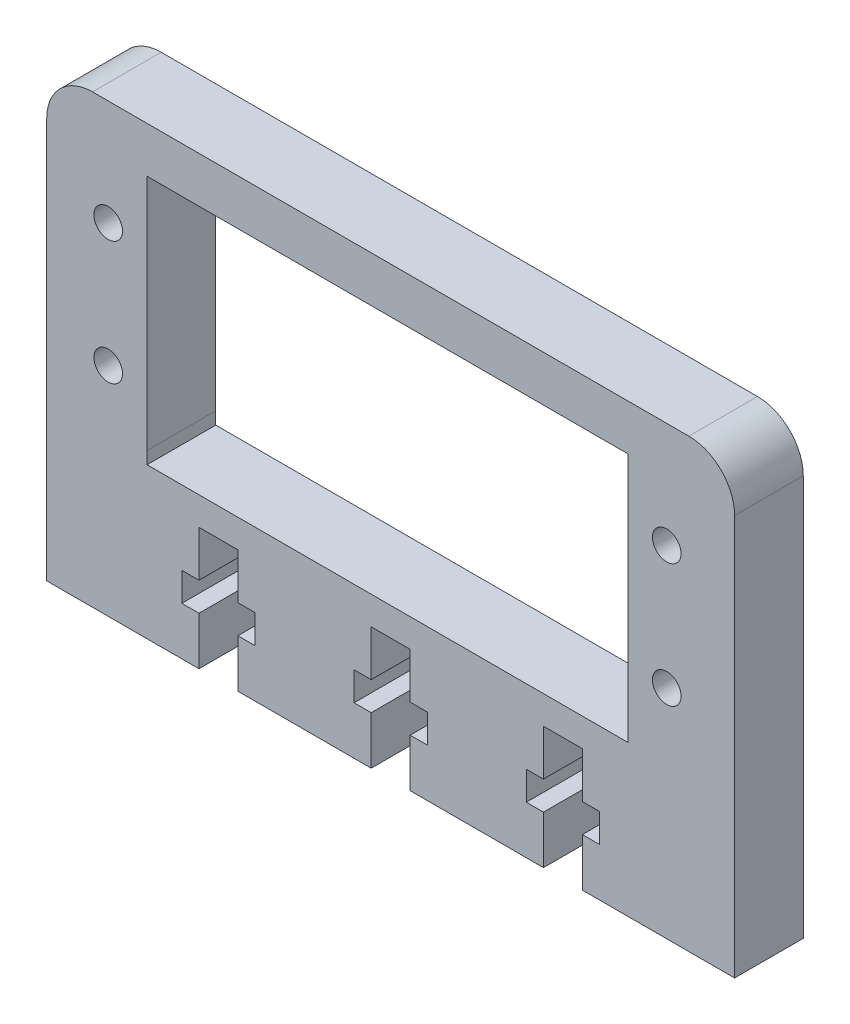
from build123d import *

# Parameters (mm, degrees)
BOSS_EXTRUDE3_DEPTH = 6
SKETCH2_W           = 21.006942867
SKETCH2_H           = 24.753402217
SKETCH2_R           = 1.25
CUT_EXTRUDE1_DEPTH  = 6
CUT_EXTRUDE3_DEPTH  = 6
SKETCH4_W           = 42.013885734
SKETCH4_H           = 4
BOSS_EXTRUDE4_DEPTH = 6


with BuildPart() as part:
    # Sketch1 → Boss-Extrude3 (new body)
    with BuildSketch(Plane.XY):
        with BuildLine():
            Line((-22.057843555, 38.208580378), (-8.757843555, 38.208580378))
            Line((-8.757843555, 38.208580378), (-8.757843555, 42.408580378))
            Line((-8.757843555, 42.408580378), (-10.257843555, 42.408580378))
            Line((-10.257843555, 42.408580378), (-10.257843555, 44.908580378))
            Line((-10.257843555, 44.908580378), (-8.757843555, 44.908580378))
            Line((-8.757843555, 44.908580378), (-8.757843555, 48.908580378))
            Line((-8.757843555, 48.908580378), (-5.357843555, 48.908580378))
            Line((-5.357843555, 48.908580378), (-5.357843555, 44.908580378))
            Line((-5.357843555, 44.908580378), (-3.857843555, 44.908580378))
            Line((-3.857843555, 44.908580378), (-3.857843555, 42.408580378))
            Line((-3.857843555, 42.408580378), (-5.357843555, 42.408580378))
            Line((-5.357843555, 42.408580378), (-5.357843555, 38.208580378))
            Line((-5.357843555, 38.208580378), (6.290955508, 38.208580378))
            Line((6.290955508, 38.208580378), (6.290955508, 42.408580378))
            Line((6.290955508, 42.408580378), (4.790955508, 42.408580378))
            Line((4.790955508, 42.408580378), (4.790955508, 44.908580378))
            Line((4.790955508, 44.908580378), (6.290955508, 44.908580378))
            Line((6.290955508, 44.908580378), (6.290955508, 48.908580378))
            Line((6.290955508, 48.908580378), (9.690955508, 48.908580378))
            Line((9.690955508, 48.908580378), (9.690955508, 44.908580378))
            Line((9.690955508, 44.908580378), (11.190955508, 44.908580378))
            Line((11.190955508, 44.908580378), (11.190955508, 42.408580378))
            Line((11.190955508, 42.408580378), (9.690955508, 42.408580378))
            Line((9.690955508, 42.408580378), (9.690955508, 38.208580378))
            Line((9.690955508, 38.208580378), (21.33975457, 38.208580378))
            Line((21.33975457, 38.208580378), (21.33975457, 42.408580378))
            Line((21.33975457, 42.408580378), (19.83975457, 42.408580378))
            Line((19.83975457, 42.408580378), (19.83975457, 44.908580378))
            Line((19.83975457, 44.908580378), (21.33975457, 44.908580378))
            Line((21.33975457, 44.908580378), (21.33975457, 48.908580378))
            Line((21.33975457, 48.908580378), (24.73975457, 48.908580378))
            Line((24.73975457, 48.908580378), (24.73975457, 44.908580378))
            Line((24.73975457, 44.908580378), (26.23975457, 44.908580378))
            Line((26.23975457, 44.908580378), (26.23975457, 42.408580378))
            Line((26.23975457, 42.408580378), (24.73975457, 42.408580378))
            Line((24.73975457, 42.408580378), (24.73975457, 38.208580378))
            Line((24.73975457, 38.208580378), (38.03975457, 38.208580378))
            Line((38.03975457, 38.208580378), (38.03975457, 73.208580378))
            ThreePointArc((38.03975457, 73.208580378), (36.868181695, 76.037007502), (34.03975457, 77.208580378))
            Line((34.03975457, 77.208580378), (-18.057843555, 77.208580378))
            ThreePointArc((-18.057843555, 77.208580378), (-20.886270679, 76.037007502), (-22.057843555, 73.208580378))
            Line((-22.057843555, 73.208580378), (-22.057843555, 38.208580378))
        make_face()
    extrude(amount=-BOSS_EXTRUDE3_DEPTH)

    # Sketch2 → Cut-Extrude1 (cut)
    with BuildSketch(Plane(origin=(0, 0, -6), x_dir=(-1, 0, 0), z_dir=(0, 0, -1))):
        with Locations((-18.214701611, 64.83187927)):
            Rectangle(SKETCH2_W, SKETCH2_H)
        with Locations((2.792241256, 64.83187927)):
            Rectangle(SKETCH2_W, SKETCH2_H)
        with Locations((-32.111230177, 67.975178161)):
            Circle(SKETCH2_R)
        with Locations((16.688769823, 67.975178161)):
            Circle(SKETCH2_R)
        with Locations((-32.111230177, 57.185178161)):
            Circle(SKETCH2_R)
        with Locations((16.688769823, 57.185178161)):
            Circle(SKETCH2_R)
    extrude(amount=-CUT_EXTRUDE1_DEPTH, mode=Mode.SUBTRACT)

    # Sketch3 → Cut-Extrude3 (cut)
    with BuildSketch(Plane(origin=(0, 0, -6), x_dir=(-1, 0, 0), z_dir=(0, 0, -1))):
        Polygon((-28.718173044, 51.376049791), (-28.718173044, 52.455178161), (13.29571269, 52.455178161), (13.294869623, 51.376049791), align=None)
    extrude(amount=-CUT_EXTRUDE3_DEPTH, mode=Mode.SUBTRACT)

    # Sketch4 → Boss-Extrude4 (add)
    with BuildSketch(Plane(origin=(0, 0, -6), x_dir=(-1, 0, 0), z_dir=(0, 0, -1))):
        with Locations((-7.711230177, 75.208580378)):
            Rectangle(SKETCH4_W, SKETCH4_H)
    extrude(amount=-BOSS_EXTRUDE4_DEPTH)


solid = part.part
